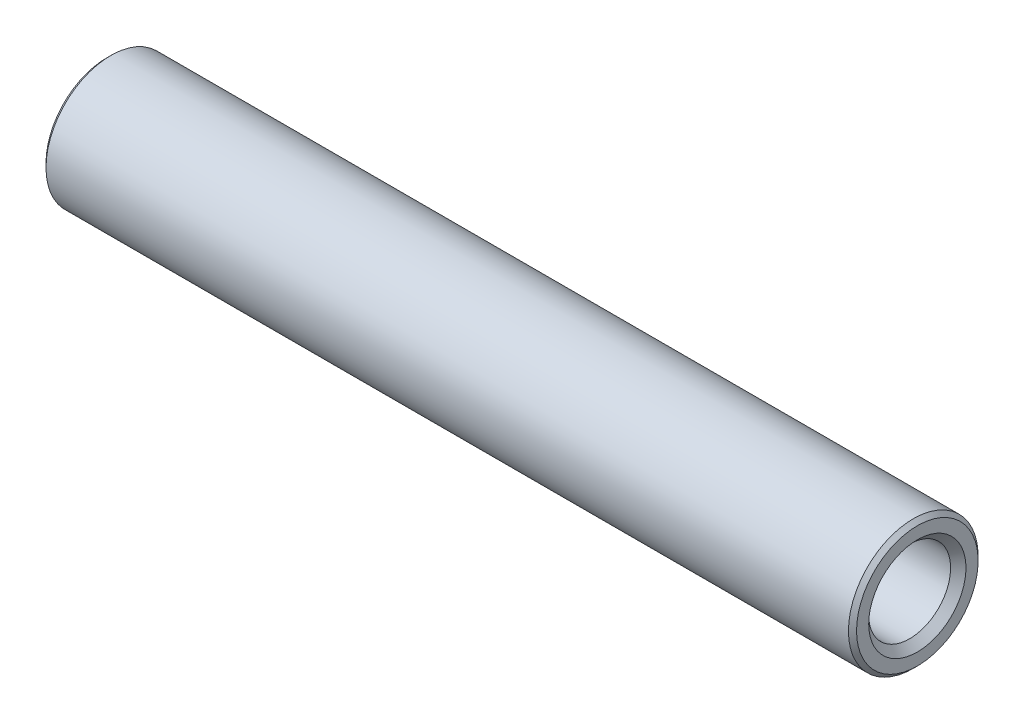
ISO-10303-21;
HEADER;
FILE_DESCRIPTION(('STEP AP214'),'2;1');
FILE_NAME('part.step','',(''),(''),'','','');
FILE_SCHEMA(('AUTOMOTIVE_DESIGN { 1 0 10303 214 1 1 1 1 }'));
ENDSEC;
DATA;
#1=APPLICATION_CONTEXT('core data for automotive mechanical design processes');
#2=APPLICATION_PROTOCOL_DEFINITION('international standard','automotive_design',2000,#1);
#3=PRODUCT_CONTEXT('',#1,'mechanical');
#4=PRODUCT('Part','Part','',(#3));
#5=PRODUCT_RELATED_PRODUCT_CATEGORY('part','',(#4));
#6=PRODUCT_DEFINITION_FORMATION('','',#4);
#7=PRODUCT_DEFINITION_CONTEXT('part definition',#1,'design');
#8=PRODUCT_DEFINITION('design','',#6,#7);
#9=PRODUCT_DEFINITION_SHAPE('','',#8);
#10=(LENGTH_UNIT() NAMED_UNIT(*) SI_UNIT(.MILLI.,.METRE.));
#11=(NAMED_UNIT(*) PLANE_ANGLE_UNIT() SI_UNIT($,.RADIAN.));
#12=(NAMED_UNIT(*) SI_UNIT($,.STERADIAN.) SOLID_ANGLE_UNIT());
#13=UNCERTAINTY_MEASURE_WITH_UNIT(LENGTH_MEASURE(1.E-05),#10,'distance_accuracy_value','');
#14=(GEOMETRIC_REPRESENTATION_CONTEXT(3) GLOBAL_UNCERTAINTY_ASSIGNED_CONTEXT((#13)) GLOBAL_UNIT_ASSIGNED_CONTEXT((#10,
#11,#12)) REPRESENTATION_CONTEXT('',''));
#15=CARTESIAN_POINT('',(0.,0.,0.));
#16=DIRECTION('',(0.,0.,1.));
#17=DIRECTION('',(1.,0.,0.));
#18=AXIS2_PLACEMENT_3D('',#15,#16,#17);
#19=CARTESIAN_POINT('',(100.,0.,0.));
#20=DIRECTION('',(-1.,0.,0.));
#21=DIRECTION('',(0.,0.,1.));
#22=AXIS2_PLACEMENT_3D('',#19,#20,#21);
#23=CYLINDRICAL_SURFACE('',#22,5.);
#24=CARTESIAN_POINT('',(27.1132486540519,0.,0.));
#25=DIRECTION('',(-1.,0.,0.));
#26=DIRECTION('',(0.,0.,1.));
#27=AXIS2_PLACEMENT_3D('',#24,#25,#26);
#28=CIRCLE('',#27,5.);
#29=CARTESIAN_POINT('',(27.1132486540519,0.,5.));
#30=VERTEX_POINT('',#29);
#31=EDGE_CURVE('E47',#30,#30,#28,.F.);
#32=ORIENTED_EDGE('',*,*,#31,.F.);
#33=EDGE_LOOP('',(#32));
#34=FACE_BOUND('',#33,.T.);
#35=CARTESIAN_POINT('',(72.8867513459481,0.,0.));
#36=DIRECTION('',(1.,0.,0.));
#37=DIRECTION('',(0.,0.,-1.));
#38=AXIS2_PLACEMENT_3D('',#35,#36,#37);
#39=CIRCLE('',#38,5.);
#40=CARTESIAN_POINT('',(72.8867513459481,0.,-5.));
#41=VERTEX_POINT('',#40);
#42=EDGE_CURVE('E35',#41,#41,#39,.F.);
#43=ORIENTED_EDGE('',*,*,#42,.F.);
#44=EDGE_LOOP('',(#43));
#45=FACE_BOUND('',#44,.T.);
#46=ADVANCED_FACE('F31',(#34,#45),#23,.F.);
#47=CARTESIAN_POINT('',(100.,5.,0.));
#48=DIRECTION('',(-1.,0.,0.));
#49=DIRECTION('',(0.,0.,1.));
#50=AXIS2_PLACEMENT_3D('',#47,#48,#49);
#51=PLANE('',#50);
#52=CARTESIAN_POINT('',(100.,0.,0.));
#53=DIRECTION('',(-1.,0.,0.));
#54=DIRECTION('',(0.,0.,1.));
#55=AXIS2_PLACEMENT_3D('',#52,#53,#54);
#56=CIRCLE('',#55,7.5);
#57=CARTESIAN_POINT('',(100.,0.,7.5));
#58=VERTEX_POINT('',#57);
#59=EDGE_CURVE('E44',#58,#58,#56,.T.);
#60=ORIENTED_EDGE('',*,*,#59,.F.);
#61=EDGE_LOOP('',(#60));
#62=FACE_BOUND('',#61,.T.);
#63=CARTESIAN_POINT('',(100.,0.,0.));
#64=DIRECTION('',(-1.,0.,0.));
#65=DIRECTION('',(0.,0.,1.));
#66=AXIS2_PLACEMENT_3D('',#63,#64,#65);
#67=CIRCLE('',#66,6.);
#68=CARTESIAN_POINT('',(100.,0.,6.));
#69=VERTEX_POINT('',#68);
#70=EDGE_CURVE('E76',#69,#69,#67,.T.);
#71=ORIENTED_EDGE('',*,*,#70,.T.);
#72=EDGE_LOOP('',(#71));
#73=FACE_BOUND('',#72,.T.);
#74=ADVANCED_FACE('F69',(#62,#73),#51,.F.);
#75=CARTESIAN_POINT('',(0.,7.5,0.));
#76=DIRECTION('',(1.,0.,0.));
#77=DIRECTION('',(0.,0.,-1.));
#78=AXIS2_PLACEMENT_3D('',#75,#76,#77);
#79=PLANE('',#78);
#80=CARTESIAN_POINT('',(0.,0.,0.));
#81=DIRECTION('',(-1.,0.,0.));
#82=DIRECTION('',(0.,0.,1.));
#83=AXIS2_PLACEMENT_3D('',#80,#81,#82);
#84=CIRCLE('',#83,7.5);
#85=CARTESIAN_POINT('',(0.,0.,7.5));
#86=VERTEX_POINT('',#85);
#87=EDGE_CURVE('E49',#86,#86,#84,.T.);
#88=ORIENTED_EDGE('',*,*,#87,.T.);
#89=EDGE_LOOP('',(#88));
#90=FACE_BOUND('',#89,.T.);
#91=CARTESIAN_POINT('',(0.,0.,0.));
#92=DIRECTION('',(-1.,0.,0.));
#93=DIRECTION('',(0.,0.,1.));
#94=AXIS2_PLACEMENT_3D('',#91,#92,#93);
#95=CIRCLE('',#94,6.);
#96=CARTESIAN_POINT('',(0.,0.,6.));
#97=VERTEX_POINT('',#96);
#98=EDGE_CURVE('E50',#97,#97,#95,.T.);
#99=ORIENTED_EDGE('',*,*,#98,.F.);
#100=EDGE_LOOP('',(#99));
#101=FACE_BOUND('',#100,.T.);
#102=ADVANCED_FACE('F72',(#90,#101),#79,.F.);
#103=CARTESIAN_POINT('',(0.5,0.,0.));
#104=DIRECTION('',(1.,0.,0.));
#105=DIRECTION('',(0.,0.,-1.));
#106=AXIS2_PLACEMENT_3D('',#103,#104,#105);
#107=CONICAL_SURFACE('',#106,8.,0.785398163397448);
#108=ORIENTED_EDGE('',*,*,#87,.F.);
#109=EDGE_LOOP('',(#108));
#110=FACE_BOUND('',#109,.T.);
#111=CARTESIAN_POINT('',(0.5,0.,0.));
#112=DIRECTION('',(-1.,0.,0.));
#113=DIRECTION('',(0.,0.,1.));
#114=AXIS2_PLACEMENT_3D('',#111,#112,#113);
#115=CIRCLE('',#114,8.);
#116=CARTESIAN_POINT('',(0.5,0.,8.));
#117=VERTEX_POINT('',#116);
#118=EDGE_CURVE('E10',#117,#117,#115,.T.);
#119=ORIENTED_EDGE('',*,*,#118,.T.);
#120=EDGE_LOOP('',(#119));
#121=FACE_BOUND('',#120,.T.);
#122=ADVANCED_FACE('F33',(#110,#121),#107,.T.);
#123=CARTESIAN_POINT('',(100.,0.,0.));
#124=DIRECTION('',(-1.,0.,0.));
#125=DIRECTION('',(0.,0.,1.));
#126=AXIS2_PLACEMENT_3D('',#123,#124,#125);
#127=CYLINDRICAL_SURFACE('',#126,8.);
#128=ORIENTED_EDGE('',*,*,#118,.F.);
#129=EDGE_LOOP('',(#128));
#130=FACE_BOUND('',#129,.T.);
#131=CARTESIAN_POINT('',(99.5,0.,0.));
#132=DIRECTION('',(-1.,0.,0.));
#133=DIRECTION('',(0.,0.,1.));
#134=AXIS2_PLACEMENT_3D('',#131,#132,#133);
#135=CIRCLE('',#134,8.);
#136=CARTESIAN_POINT('',(99.5,0.,8.));
#137=VERTEX_POINT('',#136);
#138=EDGE_CURVE('E39',#137,#137,#135,.T.);
#139=ORIENTED_EDGE('',*,*,#138,.T.);
#140=EDGE_LOOP('',(#139));
#141=FACE_BOUND('',#140,.T.);
#142=ADVANCED_FACE('F114',(#130,#141),#127,.T.);
#143=CARTESIAN_POINT('',(100.,0.,0.));
#144=DIRECTION('',(-1.,0.,0.));
#145=DIRECTION('',(0.,0.,1.));
#146=AXIS2_PLACEMENT_3D('',#143,#144,#145);
#147=CONICAL_SURFACE('',#146,7.5,0.785398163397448);
#148=ORIENTED_EDGE('',*,*,#138,.F.);
#149=EDGE_LOOP('',(#148));
#150=FACE_BOUND('',#149,.T.);
#151=ORIENTED_EDGE('',*,*,#59,.T.);
#152=EDGE_LOOP('',(#151));
#153=FACE_BOUND('',#152,.T.);
#154=ADVANCED_FACE('F67',(#150,#153),#147,.T.);
#155=CARTESIAN_POINT('',(30.,0.,0.));
#156=DIRECTION('',(-1.,0.,0.));
#157=DIRECTION('',(0.,0.,1.));
#158=AXIS2_PLACEMENT_3D('',#155,#156,#157);
#159=CONICAL_SURFACE('',#158,0.,1.0471975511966);
#160=CARTESIAN_POINT('',(27.0826490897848,0.,0.));
#161=DIRECTION('',(-1.,0.,0.));
#162=DIRECTION('',(0.,0.,1.));
#163=AXIS2_PLACEMENT_3D('',#160,#161,#162);
#164=CIRCLE('',#163,5.053);
#165=CARTESIAN_POINT('',(27.0826490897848,0.,5.053));
#166=VERTEX_POINT('',#165);
#167=EDGE_CURVE('E61',#166,#166,#164,.T.);
#168=ORIENTED_EDGE('',*,*,#167,.T.);
#169=EDGE_LOOP('',(#168));
#170=FACE_BOUND('',#169,.T.);
#171=ORIENTED_EDGE('',*,*,#31,.T.);
#172=EDGE_LOOP('',(#171));
#173=FACE_BOUND('',#172,.T.);
#174=ADVANCED_FACE('F88',(#170,#173),#159,.F.);
#175=CARTESIAN_POINT('',(0.947,0.,0.));
#176=DIRECTION('',(-1.,0.,0.));
#177=DIRECTION('',(0.,0.,1.));
#178=AXIS2_PLACEMENT_3D('',#175,#176,#177);
#179=CONICAL_SURFACE('',#178,5.053,0.785398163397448);
#180=ORIENTED_EDGE('',*,*,#98,.T.);
#181=EDGE_LOOP('',(#180));
#182=FACE_BOUND('',#181,.T.);
#183=CARTESIAN_POINT('',(0.947,0.,0.));
#184=DIRECTION('',(-1.,0.,0.));
#185=DIRECTION('',(0.,0.,1.));
#186=AXIS2_PLACEMENT_3D('',#183,#184,#185);
#187=CIRCLE('',#186,5.053);
#188=CARTESIAN_POINT('',(0.947,0.,5.053));
#189=VERTEX_POINT('',#188);
#190=EDGE_CURVE('E56',#189,#189,#187,.T.);
#191=ORIENTED_EDGE('',*,*,#190,.F.);
#192=EDGE_LOOP('',(#191));
#193=FACE_BOUND('',#192,.T.);
#194=ADVANCED_FACE('F93',(#182,#193),#179,.F.);
#195=CARTESIAN_POINT('',(30.,0.,0.));
#196=DIRECTION('',(-1.,0.,0.));
#197=DIRECTION('',(0.,0.,1.));
#198=AXIS2_PLACEMENT_3D('',#195,#196,#197);
#199=CYLINDRICAL_SURFACE('',#198,5.053);
#200=ORIENTED_EDGE('',*,*,#190,.T.);
#201=EDGE_LOOP('',(#200));
#202=FACE_BOUND('',#201,.T.);
#203=ORIENTED_EDGE('',*,*,#167,.F.);
#204=EDGE_LOOP('',(#203));
#205=FACE_BOUND('',#204,.T.);
#206=ADVANCED_FACE('F90',(#202,#205),#199,.F.);
#207=CARTESIAN_POINT('',(72.9173509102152,0.,0.));
#208=DIRECTION('',(1.,0.,0.));
#209=DIRECTION('',(0.,0.,-1.));
#210=AXIS2_PLACEMENT_3D('',#207,#208,#209);
#211=CONICAL_SURFACE('',#210,5.053,1.0471975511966);
#212=CARTESIAN_POINT('',(72.9173509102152,0.,0.));
#213=DIRECTION('',(-1.,0.,0.));
#214=DIRECTION('',(0.,0.,1.));
#215=AXIS2_PLACEMENT_3D('',#212,#213,#214);
#216=CIRCLE('',#215,5.053);
#217=CARTESIAN_POINT('',(72.9173509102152,0.,5.053));
#218=VERTEX_POINT('',#217);
#219=EDGE_CURVE('E82',#218,#218,#216,.T.);
#220=ORIENTED_EDGE('',*,*,#219,.F.);
#221=EDGE_LOOP('',(#220));
#222=FACE_BOUND('',#221,.T.);
#223=ORIENTED_EDGE('',*,*,#42,.T.);
#224=EDGE_LOOP('',(#223));
#225=FACE_BOUND('',#224,.T.);
#226=ADVANCED_FACE('F92',(#222,#225),#211,.F.);
#227=CARTESIAN_POINT('',(100.,0.,0.));
#228=DIRECTION('',(1.,0.,0.));
#229=DIRECTION('',(0.,0.,-1.));
#230=AXIS2_PLACEMENT_3D('',#227,#228,#229);
#231=CONICAL_SURFACE('',#230,6.,0.785398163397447);
#232=CARTESIAN_POINT('',(99.053,0.,0.));
#233=DIRECTION('',(-1.,0.,0.));
#234=DIRECTION('',(0.,0.,1.));
#235=AXIS2_PLACEMENT_3D('',#232,#233,#234);
#236=CIRCLE('',#235,5.053);
#237=CARTESIAN_POINT('',(99.053,0.,5.053));
#238=VERTEX_POINT('',#237);
#239=EDGE_CURVE('E78',#238,#238,#236,.T.);
#240=ORIENTED_EDGE('',*,*,#239,.T.);
#241=EDGE_LOOP('',(#240));
#242=FACE_BOUND('',#241,.T.);
#243=ORIENTED_EDGE('',*,*,#70,.F.);
#244=EDGE_LOOP('',(#243));
#245=FACE_BOUND('',#244,.T.);
#246=ADVANCED_FACE('F100',(#242,#245),#231,.F.);
#247=CARTESIAN_POINT('',(100.,0.,0.));
#248=DIRECTION('',(-1.,0.,0.));
#249=DIRECTION('',(0.,0.,1.));
#250=AXIS2_PLACEMENT_3D('',#247,#248,#249);
#251=CYLINDRICAL_SURFACE('',#250,5.053);
#252=ORIENTED_EDGE('',*,*,#219,.T.);
#253=EDGE_LOOP('',(#252));
#254=FACE_BOUND('',#253,.T.);
#255=ORIENTED_EDGE('',*,*,#239,.F.);
#256=EDGE_LOOP('',(#255));
#257=FACE_BOUND('',#256,.T.);
#258=ADVANCED_FACE('F157',(#254,#257),#251,.F.);
#259=CLOSED_SHELL('',(#46,#74,#102,#122,#142,#154,#174,#194,#206,#226,#246,#258));
#260=MANIFOLD_SOLID_BREP('B2',#259);
#261=ADVANCED_BREP_SHAPE_REPRESENTATION('',(#18,#260),#14);
#262=SHAPE_DEFINITION_REPRESENTATION(#9,#261);
ENDSEC;
END-ISO-10303-21;
